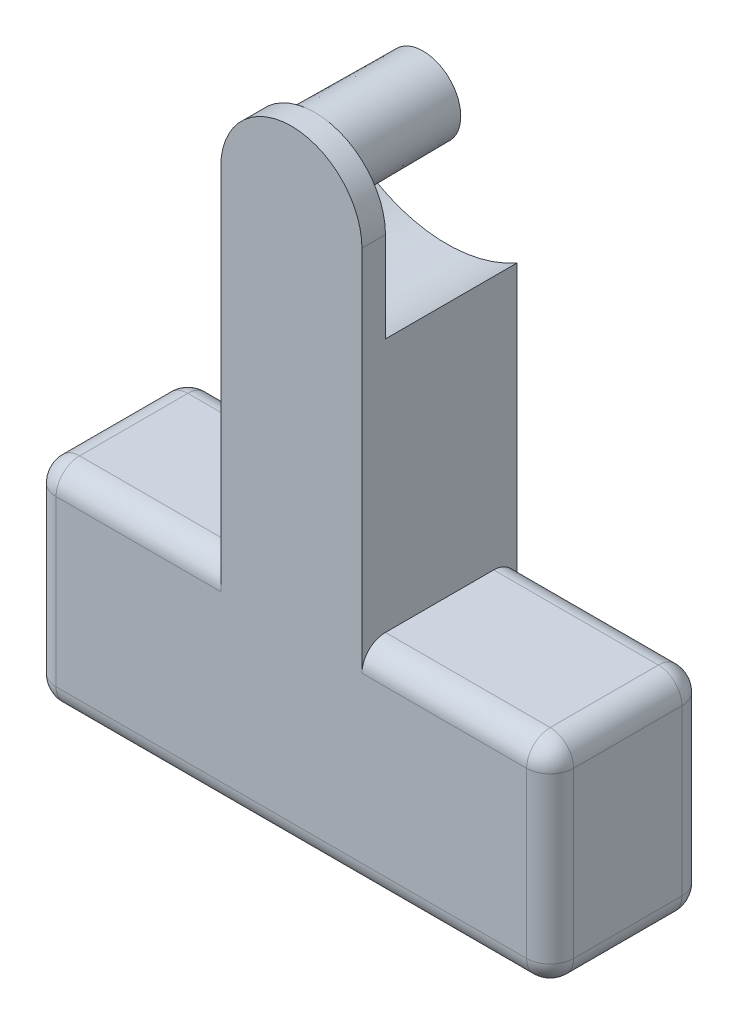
ISO-10303-21;
HEADER;
FILE_DESCRIPTION(('STEP AP214'),'2;1');
FILE_NAME('part.step','',(''),(''),'','','');
FILE_SCHEMA(('AUTOMOTIVE_DESIGN { 1 0 10303 214 1 1 1 1 }'));
ENDSEC;
DATA;
#1=APPLICATION_CONTEXT('core data for automotive mechanical design processes');
#2=APPLICATION_PROTOCOL_DEFINITION('international standard','automotive_design',2000,#1);
#3=PRODUCT_CONTEXT('',#1,'mechanical');
#4=PRODUCT('Part','Part','',(#3));
#5=PRODUCT_RELATED_PRODUCT_CATEGORY('part','',(#4));
#6=PRODUCT_DEFINITION_FORMATION('','',#4);
#7=PRODUCT_DEFINITION_CONTEXT('part definition',#1,'design');
#8=PRODUCT_DEFINITION('design','',#6,#7);
#9=PRODUCT_DEFINITION_SHAPE('','',#8);
#10=(LENGTH_UNIT() NAMED_UNIT(*) SI_UNIT(.MILLI.,.METRE.));
#11=(NAMED_UNIT(*) PLANE_ANGLE_UNIT() SI_UNIT($,.RADIAN.));
#12=(NAMED_UNIT(*) SI_UNIT($,.STERADIAN.) SOLID_ANGLE_UNIT());
#13=UNCERTAINTY_MEASURE_WITH_UNIT(LENGTH_MEASURE(1.E-05),#10,'distance_accuracy_value','');
#14=(GEOMETRIC_REPRESENTATION_CONTEXT(3) GLOBAL_UNCERTAINTY_ASSIGNED_CONTEXT((#13)) GLOBAL_UNIT_ASSIGNED_CONTEXT((#10,
#11,#12)) REPRESENTATION_CONTEXT('',''));
#15=CARTESIAN_POINT('',(0.,0.,0.));
#16=DIRECTION('',(0.,0.,1.));
#17=DIRECTION('',(1.,0.,0.));
#18=AXIS2_PLACEMENT_3D('',#15,#16,#17);
#19=CARTESIAN_POINT('',(0.,-6.79928204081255,11.5));
#20=DIRECTION('',(0.,0.,1.));
#21=DIRECTION('',(1.,0.,0.));
#22=AXIS2_PLACEMENT_3D('',#19,#20,#21);
#23=PLANE('',#22);
#24=DIRECTION('',(0.,1.,0.));
#25=VECTOR('',#24,1.);
#26=CARTESIAN_POINT('',(15.,-80.,11.5));
#27=LINE('',#26,#25);
#28=CARTESIAN_POINT('',(15.,-25.9807621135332,11.5));
#29=VERTEX_POINT('',#28);
#30=CARTESIAN_POINT('',(15.,-6.79928204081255,11.5));
#31=VERTEX_POINT('',#30);
#32=EDGE_CURVE('E194',#29,#31,#27,.T.);
#33=ORIENTED_EDGE('',*,*,#32,.F.);
#34=CARTESIAN_POINT('',(0.,0.,11.5));
#35=DIRECTION('',(0.,0.,-1.));
#36=DIRECTION('',(-1.,0.,0.));
#37=AXIS2_PLACEMENT_3D('',#34,#35,#36);
#38=CIRCLE('',#37,30.);
#39=CARTESIAN_POINT('',(-15.,-25.9807621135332,11.5));
#40=VERTEX_POINT('',#39);
#41=EDGE_CURVE('E203',#29,#40,#38,.T.);
#42=ORIENTED_EDGE('',*,*,#41,.T.);
#43=DIRECTION('',(0.,-1.,0.));
#44=VECTOR('',#43,1.);
#45=CARTESIAN_POINT('',(-15.,-6.79928204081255,11.5));
#46=LINE('',#45,#44);
#47=CARTESIAN_POINT('',(-15.,-6.79928204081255,11.5));
#48=VERTEX_POINT('',#47);
#49=EDGE_CURVE('E215',#48,#40,#46,.T.);
#50=ORIENTED_EDGE('',*,*,#49,.F.);
#51=CARTESIAN_POINT('',(0.,-6.79928204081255,11.5));
#52=DIRECTION('',(0.,0.,1.));
#53=DIRECTION('',(1.,0.,0.));
#54=AXIS2_PLACEMENT_3D('',#51,#52,#53);
#55=CIRCLE('',#54,15.);
#56=CARTESIAN_POINT('',(0.,8.20071795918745,11.5));
#57=VERTEX_POINT('',#56);
#58=EDGE_CURVE('E456',#57,#48,#55,.T.);
#59=ORIENTED_EDGE('',*,*,#58,.F.);
#60=CARTESIAN_POINT('',(0.,0.,11.5));
#61=DIRECTION('',(0.,0.,1.));
#62=DIRECTION('',(1.,0.,0.));
#63=AXIS2_PLACEMENT_3D('',#60,#61,#62);
#64=CIRCLE('',#63,8.20071795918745);
#65=EDGE_CURVE('E238',#57,#57,#64,.T.);
#66=ORIENTED_EDGE('',*,*,#65,.T.);
#67=EDGE_CURVE('E213',#31,#57,#55,.T.);
#68=ORIENTED_EDGE('',*,*,#67,.F.);
#69=EDGE_LOOP('',(#33,#42,#50,#59,#66,#68));
#70=FACE_BOUND('',#69,.T.);
#71=ADVANCED_FACE('F47',(#70),#23,.F.);
#72=CARTESIAN_POINT('',(0.,0.,-11.5));
#73=DIRECTION('',(0.,0.,1.));
#74=DIRECTION('',(1.,0.,0.));
#75=AXIS2_PLACEMENT_3D('',#72,#73,#74);
#76=CONICAL_SURFACE('',#75,8.,0.00872664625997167);
#77=ORIENTED_EDGE('',*,*,#65,.F.);
#78=EDGE_LOOP('',(#77));
#79=FACE_BOUND('',#78,.T.);
#80=CARTESIAN_POINT('',(0.,0.,-11.5));
#81=DIRECTION('',(0.,0.,1.));
#82=DIRECTION('',(1.,0.,0.));
#83=AXIS2_PLACEMENT_3D('',#80,#81,#82);
#84=CIRCLE('',#83,8.);
#85=CARTESIAN_POINT('',(8.,0.,-11.5));
#86=VERTEX_POINT('',#85);
#87=EDGE_CURVE('E235',#86,#86,#84,.T.);
#88=ORIENTED_EDGE('',*,*,#87,.T.);
#89=EDGE_LOOP('',(#88));
#90=FACE_BOUND('',#89,.T.);
#91=ADVANCED_FACE('F478',(#79,#90),#76,.T.);
#92=CARTESIAN_POINT('',(0.,0.,-11.5));
#93=DIRECTION('',(0.,0.,1.));
#94=DIRECTION('',(1.,0.,0.));
#95=AXIS2_PLACEMENT_3D('',#92,#93,#94);
#96=PLANE('',#95);
#97=ORIENTED_EDGE('',*,*,#87,.F.);
#98=EDGE_LOOP('',(#97));
#99=FACE_BOUND('',#98,.T.);
#100=ADVANCED_FACE('F485',(#99),#96,.F.);
#101=CARTESIAN_POINT('',(0.,-6.79928204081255,16.5));
#102=DIRECTION('',(0.,0.,-1.));
#103=DIRECTION('',(-1.,0.,0.));
#104=AXIS2_PLACEMENT_3D('',#101,#102,#103);
#105=CYLINDRICAL_SURFACE('',#104,15.);
#106=ORIENTED_EDGE('',*,*,#67,.T.);
#107=ORIENTED_EDGE('',*,*,#58,.T.);
#108=DIRECTION('',(0.,0.,-1.));
#109=VECTOR('',#108,1.);
#110=CARTESIAN_POINT('',(-15.,-6.79928204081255,16.5));
#111=LINE('',#110,#109);
#112=CARTESIAN_POINT('',(-15.,-6.79928204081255,16.5));
#113=VERTEX_POINT('',#112);
#114=EDGE_CURVE('E232',#113,#48,#111,.T.);
#115=ORIENTED_EDGE('',*,*,#114,.F.);
#116=CARTESIAN_POINT('',(0.,-6.79928204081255,16.5));
#117=DIRECTION('',(0.,0.,1.));
#118=DIRECTION('',(1.,0.,0.));
#119=AXIS2_PLACEMENT_3D('',#116,#117,#118);
#120=CIRCLE('',#119,15.);
#121=CARTESIAN_POINT('',(15.,-6.79928204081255,16.5));
#122=VERTEX_POINT('',#121);
#123=EDGE_CURVE('E214',#122,#113,#120,.T.);
#124=ORIENTED_EDGE('',*,*,#123,.F.);
#125=DIRECTION('',(0.,0.,-1.));
#126=VECTOR('',#125,1.);
#127=CARTESIAN_POINT('',(15.,-6.79928204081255,16.5));
#128=LINE('',#127,#126);
#129=EDGE_CURVE('E223',#122,#31,#128,.T.);
#130=ORIENTED_EDGE('',*,*,#129,.T.);
#131=EDGE_LOOP('',(#106,#107,#115,#124,#130));
#132=FACE_BOUND('',#131,.T.);
#133=ADVANCED_FACE('F465',(#132),#105,.T.);
#134=CARTESIAN_POINT('',(-15.,-6.79928204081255,16.5));
#135=DIRECTION('',(1.,0.,0.));
#136=DIRECTION('',(0.,1.,0.));
#137=AXIS2_PLACEMENT_3D('',#134,#135,#136);
#138=PLANE('',#137);
#139=ORIENTED_EDGE('',*,*,#49,.T.);
#140=DIRECTION('',(0.,0.,1.));
#141=VECTOR('',#140,1.);
#142=CARTESIAN_POINT('',(-15.,-25.9807621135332,-169.502734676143));
#143=LINE('',#142,#141);
#144=CARTESIAN_POINT('',(-15.,-25.9807621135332,-16.5));
#145=VERTEX_POINT('',#144);
#146=EDGE_CURVE('E200',#145,#40,#143,.T.);
#147=ORIENTED_EDGE('',*,*,#146,.F.);
#148=DIRECTION('',(0.,-1.,0.));
#149=VECTOR('',#148,1.);
#150=CARTESIAN_POINT('',(-15.,0.,-16.5));
#151=LINE('',#150,#149);
#152=CARTESIAN_POINT('',(-15.,-85.,-16.5));
#153=VERTEX_POINT('',#152);
#154=EDGE_CURVE('E199',#145,#153,#151,.T.);
#155=ORIENTED_EDGE('',*,*,#154,.T.);
#156=CARTESIAN_POINT('',(-15.,-85.,-11.5));
#157=DIRECTION('',(1.,0.,0.));
#158=DIRECTION('',(0.,1.,0.));
#159=AXIS2_PLACEMENT_3D('',#156,#157,#158);
#160=CIRCLE('',#159,5.);
#161=CARTESIAN_POINT('',(-15.,-80.,-11.5));
#162=VERTEX_POINT('',#161);
#163=EDGE_CURVE('E56',#153,#162,#160,.T.);
#164=ORIENTED_EDGE('',*,*,#163,.T.);
#165=DIRECTION('',(0.,0.,-1.));
#166=VECTOR('',#165,1.);
#167=CARTESIAN_POINT('',(-15.,-80.,16.5));
#168=LINE('',#167,#166);
#169=CARTESIAN_POINT('',(-15.,-80.,11.5));
#170=VERTEX_POINT('',#169);
#171=EDGE_CURVE('E229',#170,#162,#168,.T.);
#172=ORIENTED_EDGE('',*,*,#171,.F.);
#173=CARTESIAN_POINT('',(-15.,-85.,11.5));
#174=DIRECTION('',(1.,0.,0.));
#175=DIRECTION('',(0.,1.,0.));
#176=AXIS2_PLACEMENT_3D('',#173,#174,#175);
#177=CIRCLE('',#176,5.);
#178=CARTESIAN_POINT('',(-15.,-85.,16.5));
#179=VERTEX_POINT('',#178);
#180=EDGE_CURVE('E299',#170,#179,#177,.T.);
#181=ORIENTED_EDGE('',*,*,#180,.T.);
#182=DIRECTION('',(0.,-1.,0.));
#183=VECTOR('',#182,1.);
#184=CARTESIAN_POINT('',(-15.,-6.79928204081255,16.5));
#185=LINE('',#184,#183);
#186=EDGE_CURVE('E218',#113,#179,#185,.T.);
#187=ORIENTED_EDGE('',*,*,#186,.F.);
#188=ORIENTED_EDGE('',*,*,#114,.T.);
#189=EDGE_LOOP('',(#139,#147,#155,#164,#172,#181,#187,#188));
#190=FACE_BOUND('',#189,.T.);
#191=ADVANCED_FACE('F468',(#190),#138,.F.);
#192=CARTESIAN_POINT('',(-15.,-80.,16.5));
#193=DIRECTION('',(0.,-1.,0.));
#194=DIRECTION('',(1.,0.,0.));
#195=AXIS2_PLACEMENT_3D('',#192,#193,#194);
#196=PLANE('',#195);
#197=DIRECTION('',(0.,0.,-1.));
#198=VECTOR('',#197,1.);
#199=CARTESIAN_POINT('',(-50.,-80.,16.5));
#200=LINE('',#199,#198);
#201=CARTESIAN_POINT('',(-50.,-80.,-11.5));
#202=VERTEX_POINT('',#201);
#203=CARTESIAN_POINT('',(-50.,-80.,11.5));
#204=VERTEX_POINT('',#203);
#205=EDGE_CURVE('E272',#202,#204,#200,.F.);
#206=ORIENTED_EDGE('',*,*,#205,.T.);
#207=DIRECTION('',(-1.,0.,0.));
#208=VECTOR('',#207,1.);
#209=CARTESIAN_POINT('',(-15.,-80.,11.5));
#210=LINE('',#209,#208);
#211=EDGE_CURVE('E276',#204,#170,#210,.F.);
#212=ORIENTED_EDGE('',*,*,#211,.T.);
#213=ORIENTED_EDGE('',*,*,#171,.T.);
#214=DIRECTION('',(1.,0.,0.));
#215=VECTOR('',#214,1.);
#216=CARTESIAN_POINT('',(-15.,-80.,-11.5));
#217=LINE('',#216,#215);
#218=EDGE_CURVE('E274',#162,#202,#217,.F.);
#219=ORIENTED_EDGE('',*,*,#218,.T.);
#220=EDGE_LOOP('',(#206,#212,#213,#219));
#221=FACE_BOUND('',#220,.T.);
#222=ADVANCED_FACE('F505',(#221),#196,.F.);
#223=CARTESIAN_POINT('',(-55.,-125.,16.5));
#224=DIRECTION('',(1.,0.,0.));
#225=DIRECTION('',(0.,1.,0.));
#226=AXIS2_PLACEMENT_3D('',#223,#224,#225);
#227=PLANE('',#226);
#228=DIRECTION('',(0.,-1.,0.));
#229=VECTOR('',#228,1.);
#230=CARTESIAN_POINT('',(-55.,-125.,-11.5));
#231=LINE('',#230,#229);
#232=CARTESIAN_POINT('',(-55.,-85.,-11.5));
#233=VERTEX_POINT('',#232);
#234=CARTESIAN_POINT('',(-55.,-120.,-11.5));
#235=VERTEX_POINT('',#234);
#236=EDGE_CURVE('E64',#233,#235,#231,.T.);
#237=ORIENTED_EDGE('',*,*,#236,.T.);
#238=DIRECTION('',(0.,0.,-1.));
#239=VECTOR('',#238,1.);
#240=CARTESIAN_POINT('',(-55.,-120.,16.5));
#241=LINE('',#240,#239);
#242=CARTESIAN_POINT('',(-55.,-120.,11.5));
#243=VERTEX_POINT('',#242);
#244=EDGE_CURVE('E297',#235,#243,#241,.F.);
#245=ORIENTED_EDGE('',*,*,#244,.T.);
#246=DIRECTION('',(0.,-1.,0.));
#247=VECTOR('',#246,1.);
#248=CARTESIAN_POINT('',(-55.,-80.,11.5));
#249=LINE('',#248,#247);
#250=CARTESIAN_POINT('',(-55.,-85.,11.5));
#251=VERTEX_POINT('',#250);
#252=EDGE_CURVE('E293',#243,#251,#249,.F.);
#253=ORIENTED_EDGE('',*,*,#252,.T.);
#254=DIRECTION('',(0.,0.,-1.));
#255=VECTOR('',#254,1.);
#256=CARTESIAN_POINT('',(-55.,-85.,16.5));
#257=LINE('',#256,#255);
#258=EDGE_CURVE('E69',#251,#233,#257,.T.);
#259=ORIENTED_EDGE('',*,*,#258,.T.);
#260=EDGE_LOOP('',(#237,#245,#253,#259));
#261=FACE_BOUND('',#260,.T.);
#262=ADVANCED_FACE('F402',(#261),#227,.F.);
#263=CARTESIAN_POINT('',(55.,-125.,16.5));
#264=DIRECTION('',(0.,1.,0.));
#265=DIRECTION('',(0.,0.,1.));
#266=AXIS2_PLACEMENT_3D('',#263,#264,#265);
#267=PLANE('',#266);
#268=DIRECTION('',(0.,0.,-1.));
#269=VECTOR('',#268,1.);
#270=CARTESIAN_POINT('',(-50.,-125.,16.5));
#271=LINE('',#270,#269);
#272=CARTESIAN_POINT('',(-50.,-125.,11.5));
#273=VERTEX_POINT('',#272);
#274=CARTESIAN_POINT('',(-50.,-125.,-11.5));
#275=VERTEX_POINT('',#274);
#276=EDGE_CURVE('E240',#273,#275,#271,.T.);
#277=ORIENTED_EDGE('',*,*,#276,.T.);
#278=DIRECTION('',(1.,0.,0.));
#279=VECTOR('',#278,1.);
#280=CARTESIAN_POINT('',(55.,-125.,-11.5));
#281=LINE('',#280,#279);
#282=CARTESIAN_POINT('',(50.,-125.,-11.5));
#283=VERTEX_POINT('',#282);
#284=EDGE_CURVE('E246',#275,#283,#281,.T.);
#285=ORIENTED_EDGE('',*,*,#284,.T.);
#286=DIRECTION('',(0.,0.,-1.));
#287=VECTOR('',#286,1.);
#288=CARTESIAN_POINT('',(50.,-125.,16.5));
#289=LINE('',#288,#287);
#290=CARTESIAN_POINT('',(50.,-125.,11.5));
#291=VERTEX_POINT('',#290);
#292=EDGE_CURVE('E244',#283,#291,#289,.F.);
#293=ORIENTED_EDGE('',*,*,#292,.T.);
#294=DIRECTION('',(1.,0.,0.));
#295=VECTOR('',#294,1.);
#296=CARTESIAN_POINT('',(-55.,-125.,11.5));
#297=LINE('',#296,#295);
#298=EDGE_CURVE('E242',#291,#273,#297,.F.);
#299=ORIENTED_EDGE('',*,*,#298,.T.);
#300=EDGE_LOOP('',(#277,#285,#293,#299));
#301=FACE_BOUND('',#300,.T.);
#302=ADVANCED_FACE('F498',(#301),#267,.F.);
#303=CARTESIAN_POINT('',(55.,-125.,16.5));
#304=DIRECTION('',(-1.,0.,0.));
#305=DIRECTION('',(0.,0.,1.));
#306=AXIS2_PLACEMENT_3D('',#303,#304,#305);
#307=PLANE('',#306);
#308=DIRECTION('',(0.,1.,0.));
#309=VECTOR('',#308,1.);
#310=CARTESIAN_POINT('',(55.,-125.,11.5));
#311=LINE('',#310,#309);
#312=CARTESIAN_POINT('',(55.,-85.,11.5));
#313=VERTEX_POINT('',#312);
#314=CARTESIAN_POINT('',(55.,-120.,11.5));
#315=VERTEX_POINT('',#314);
#316=EDGE_CURVE('E284',#313,#315,#311,.F.);
#317=ORIENTED_EDGE('',*,*,#316,.T.);
#318=DIRECTION('',(0.,0.,-1.));
#319=VECTOR('',#318,1.);
#320=CARTESIAN_POINT('',(55.,-120.,16.5));
#321=LINE('',#320,#319);
#322=CARTESIAN_POINT('',(55.,-120.,-11.5));
#323=VERTEX_POINT('',#322);
#324=EDGE_CURVE('E290',#315,#323,#321,.T.);
#325=ORIENTED_EDGE('',*,*,#324,.T.);
#326=DIRECTION('',(0.,1.,0.));
#327=VECTOR('',#326,1.);
#328=CARTESIAN_POINT('',(55.,-125.,-11.5));
#329=LINE('',#328,#327);
#330=CARTESIAN_POINT('',(55.,-85.,-11.5));
#331=VERTEX_POINT('',#330);
#332=EDGE_CURVE('E288',#323,#331,#329,.T.);
#333=ORIENTED_EDGE('',*,*,#332,.T.);
#334=DIRECTION('',(0.,0.,-1.));
#335=VECTOR('',#334,1.);
#336=CARTESIAN_POINT('',(55.,-85.,16.5));
#337=LINE('',#336,#335);
#338=EDGE_CURVE('E286',#331,#313,#337,.F.);
#339=ORIENTED_EDGE('',*,*,#338,.T.);
#340=EDGE_LOOP('',(#317,#325,#333,#339));
#341=FACE_BOUND('',#340,.T.);
#342=ADVANCED_FACE('F495',(#341),#307,.F.);
#343=CARTESIAN_POINT('',(55.,-80.,16.5));
#344=DIRECTION('',(0.,-1.,0.));
#345=DIRECTION('',(0.,0.,-1.));
#346=AXIS2_PLACEMENT_3D('',#343,#344,#345);
#347=PLANE('',#346);
#348=DIRECTION('',(0.,0.,-1.));
#349=VECTOR('',#348,1.);
#350=CARTESIAN_POINT('',(15.,-80.,16.5));
#351=LINE('',#350,#349);
#352=CARTESIAN_POINT('',(15.,-80.,11.5));
#353=VERTEX_POINT('',#352);
#354=CARTESIAN_POINT('',(15.,-80.,-11.5));
#355=VERTEX_POINT('',#354);
#356=EDGE_CURVE('E225',#353,#355,#351,.T.);
#357=ORIENTED_EDGE('',*,*,#356,.F.);
#358=DIRECTION('',(-1.,0.,0.));
#359=VECTOR('',#358,1.);
#360=CARTESIAN_POINT('',(55.,-80.,11.5));
#361=LINE('',#360,#359);
#362=CARTESIAN_POINT('',(50.,-80.,11.5));
#363=VERTEX_POINT('',#362);
#364=EDGE_CURVE('E282',#353,#363,#361,.F.);
#365=ORIENTED_EDGE('',*,*,#364,.T.);
#366=DIRECTION('',(0.,0.,-1.));
#367=VECTOR('',#366,1.);
#368=CARTESIAN_POINT('',(50.,-80.,16.5));
#369=LINE('',#368,#367);
#370=CARTESIAN_POINT('',(50.,-80.,-11.5));
#371=VERTEX_POINT('',#370);
#372=EDGE_CURVE('E278',#363,#371,#369,.T.);
#373=ORIENTED_EDGE('',*,*,#372,.T.);
#374=DIRECTION('',(1.,0.,0.));
#375=VECTOR('',#374,1.);
#376=CARTESIAN_POINT('',(55.,-80.,-11.5));
#377=LINE('',#376,#375);
#378=EDGE_CURVE('E280',#371,#355,#377,.F.);
#379=ORIENTED_EDGE('',*,*,#378,.T.);
#380=EDGE_LOOP('',(#357,#365,#373,#379));
#381=FACE_BOUND('',#380,.T.);
#382=ADVANCED_FACE('F432',(#381),#347,.F.);
#383=CARTESIAN_POINT('',(15.,-80.,16.5));
#384=DIRECTION('',(-1.,0.,0.));
#385=DIRECTION('',(0.,0.,1.));
#386=AXIS2_PLACEMENT_3D('',#383,#384,#385);
#387=PLANE('',#386);
#388=DIRECTION('',(0.,1.,0.));
#389=VECTOR('',#388,1.);
#390=CARTESIAN_POINT('',(15.,-80.,16.5));
#391=LINE('',#390,#389);
#392=CARTESIAN_POINT('',(15.,-85.,16.5));
#393=VERTEX_POINT('',#392);
#394=EDGE_CURVE('E226',#393,#122,#391,.T.);
#395=ORIENTED_EDGE('',*,*,#394,.F.);
#396=CARTESIAN_POINT('',(15.,-85.,11.5));
#397=DIRECTION('',(-1.,0.,0.));
#398=DIRECTION('',(0.,0.,1.));
#399=AXIS2_PLACEMENT_3D('',#396,#397,#398);
#400=CIRCLE('',#399,5.);
#401=EDGE_CURVE('E302',#393,#353,#400,.T.);
#402=ORIENTED_EDGE('',*,*,#401,.T.);
#403=ORIENTED_EDGE('',*,*,#356,.T.);
#404=CARTESIAN_POINT('',(15.,-85.,-11.5));
#405=DIRECTION('',(-1.,0.,0.));
#406=DIRECTION('',(0.,0.,1.));
#407=AXIS2_PLACEMENT_3D('',#404,#405,#406);
#408=CIRCLE('',#407,5.);
#409=CARTESIAN_POINT('',(15.,-85.,-16.5));
#410=VERTEX_POINT('',#409);
#411=EDGE_CURVE('E12',#355,#410,#408,.T.);
#412=ORIENTED_EDGE('',*,*,#411,.T.);
#413=DIRECTION('',(0.,1.,0.));
#414=VECTOR('',#413,1.);
#415=CARTESIAN_POINT('',(15.,0.,-16.5));
#416=LINE('',#415,#414);
#417=CARTESIAN_POINT('',(15.,-25.9807621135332,-16.5));
#418=VERTEX_POINT('',#417);
#419=EDGE_CURVE('E196',#410,#418,#416,.T.);
#420=ORIENTED_EDGE('',*,*,#419,.T.);
#421=DIRECTION('',(0.,0.,1.));
#422=VECTOR('',#421,1.);
#423=CARTESIAN_POINT('',(15.,-25.9807621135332,-169.502734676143));
#424=LINE('',#423,#422);
#425=EDGE_CURVE('E189',#418,#29,#424,.T.);
#426=ORIENTED_EDGE('',*,*,#425,.T.);
#427=ORIENTED_EDGE('',*,*,#32,.T.);
#428=ORIENTED_EDGE('',*,*,#129,.F.);
#429=EDGE_LOOP('',(#395,#402,#403,#412,#420,#426,#427,#428));
#430=FACE_BOUND('',#429,.T.);
#431=ADVANCED_FACE('F191',(#430),#387,.F.);
#432=CARTESIAN_POINT('',(0.,-6.79928204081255,16.5));
#433=DIRECTION('',(0.,0.,1.));
#434=DIRECTION('',(1.,0.,0.));
#435=AXIS2_PLACEMENT_3D('',#432,#433,#434);
#436=PLANE('',#435);
#437=ORIENTED_EDGE('',*,*,#186,.T.);
#438=DIRECTION('',(-1.,0.,0.));
#439=VECTOR('',#438,1.);
#440=CARTESIAN_POINT('',(-55.,-85.,16.5));
#441=LINE('',#440,#439);
#442=CARTESIAN_POINT('',(-50.,-85.,16.5));
#443=VERTEX_POINT('',#442);
#444=EDGE_CURVE('E270',#179,#443,#441,.T.);
#445=ORIENTED_EDGE('',*,*,#444,.T.);
#446=DIRECTION('',(0.,-1.,0.));
#447=VECTOR('',#446,1.);
#448=CARTESIAN_POINT('',(-50.,-125.,16.5));
#449=LINE('',#448,#447);
#450=CARTESIAN_POINT('',(-50.,-120.,16.5));
#451=VERTEX_POINT('',#450);
#452=EDGE_CURVE('E261',#443,#451,#449,.T.);
#453=ORIENTED_EDGE('',*,*,#452,.T.);
#454=DIRECTION('',(1.,0.,0.));
#455=VECTOR('',#454,1.);
#456=CARTESIAN_POINT('',(55.,-120.,16.5));
#457=LINE('',#456,#455);
#458=CARTESIAN_POINT('',(50.,-120.,16.5));
#459=VERTEX_POINT('',#458);
#460=EDGE_CURVE('E263',#451,#459,#457,.T.);
#461=ORIENTED_EDGE('',*,*,#460,.T.);
#462=DIRECTION('',(0.,1.,0.));
#463=VECTOR('',#462,1.);
#464=CARTESIAN_POINT('',(50.,-80.,16.5));
#465=LINE('',#464,#463);
#466=CARTESIAN_POINT('',(50.,-85.,16.5));
#467=VERTEX_POINT('',#466);
#468=EDGE_CURVE('E265',#459,#467,#465,.T.);
#469=ORIENTED_EDGE('',*,*,#468,.T.);
#470=DIRECTION('',(-1.,0.,0.));
#471=VECTOR('',#470,1.);
#472=CARTESIAN_POINT('',(15.,-85.,16.5));
#473=LINE('',#472,#471);
#474=EDGE_CURVE('E267',#467,#393,#473,.T.);
#475=ORIENTED_EDGE('',*,*,#474,.T.);
#476=ORIENTED_EDGE('',*,*,#394,.T.);
#477=ORIENTED_EDGE('',*,*,#123,.T.);
#478=EDGE_LOOP('',(#437,#445,#453,#461,#469,#475,#476,#477));
#479=FACE_BOUND('',#478,.T.);
#480=ADVANCED_FACE('F409',(#479),#436,.T.);
#481=CARTESIAN_POINT('',(0.,0.,-169.502734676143));
#482=DIRECTION('',(0.,0.,1.));
#483=DIRECTION('',(1.,0.,0.));
#484=AXIS2_PLACEMENT_3D('',#481,#482,#483);
#485=CYLINDRICAL_SURFACE('',#484,30.);
#486=CARTESIAN_POINT('',(0.,0.,-16.5));
#487=DIRECTION('',(0.,0.,1.));
#488=DIRECTION('',(1.,0.,0.));
#489=AXIS2_PLACEMENT_3D('',#486,#487,#488);
#490=CIRCLE('',#489,30.);
#491=EDGE_CURVE('E454',#145,#418,#490,.T.);
#492=ORIENTED_EDGE('',*,*,#491,.F.);
#493=ORIENTED_EDGE('',*,*,#146,.T.);
#494=ORIENTED_EDGE('',*,*,#41,.F.);
#495=ORIENTED_EDGE('',*,*,#425,.F.);
#496=EDGE_LOOP('',(#492,#493,#494,#495));
#497=FACE_BOUND('',#496,.T.);
#498=ADVANCED_FACE('F204',(#497),#485,.F.);
#499=CARTESIAN_POINT('',(0.,0.,-16.5));
#500=DIRECTION('',(0.,0.,1.));
#501=DIRECTION('',(1.,0.,0.));
#502=AXIS2_PLACEMENT_3D('',#499,#500,#501);
#503=PLANE('',#502);
#504=ORIENTED_EDGE('',*,*,#419,.F.);
#505=DIRECTION('',(1.,0.,0.));
#506=VECTOR('',#505,1.);
#507=CARTESIAN_POINT('',(0.,-85.,-16.5));
#508=LINE('',#507,#506);
#509=CARTESIAN_POINT('',(50.,-85.,-16.5));
#510=VERTEX_POINT('',#509);
#511=EDGE_CURVE('E259',#410,#510,#508,.T.);
#512=ORIENTED_EDGE('',*,*,#511,.T.);
#513=DIRECTION('',(0.,1.,0.));
#514=VECTOR('',#513,1.);
#515=CARTESIAN_POINT('',(50.,0.,-16.5));
#516=LINE('',#515,#514);
#517=CARTESIAN_POINT('',(50.,-120.,-16.5));
#518=VERTEX_POINT('',#517);
#519=EDGE_CURVE('E257',#510,#518,#516,.F.);
#520=ORIENTED_EDGE('',*,*,#519,.T.);
#521=DIRECTION('',(1.,0.,0.));
#522=VECTOR('',#521,1.);
#523=CARTESIAN_POINT('',(0.,-120.,-16.5));
#524=LINE('',#523,#522);
#525=CARTESIAN_POINT('',(-50.,-120.,-16.5));
#526=VERTEX_POINT('',#525);
#527=EDGE_CURVE('E254',#518,#526,#524,.F.);
#528=ORIENTED_EDGE('',*,*,#527,.T.);
#529=DIRECTION('',(0.,-1.,0.));
#530=VECTOR('',#529,1.);
#531=CARTESIAN_POINT('',(-50.,0.,-16.5));
#532=LINE('',#531,#530);
#533=CARTESIAN_POINT('',(-50.,-85.,-16.5));
#534=VERTEX_POINT('',#533);
#535=EDGE_CURVE('E249',#526,#534,#532,.F.);
#536=ORIENTED_EDGE('',*,*,#535,.T.);
#537=DIRECTION('',(1.,0.,0.));
#538=VECTOR('',#537,1.);
#539=CARTESIAN_POINT('',(0.,-85.,-16.5));
#540=LINE('',#539,#538);
#541=EDGE_CURVE('E251',#534,#153,#540,.T.);
#542=ORIENTED_EDGE('',*,*,#541,.T.);
#543=ORIENTED_EDGE('',*,*,#154,.F.);
#544=ORIENTED_EDGE('',*,*,#491,.T.);
#545=EDGE_LOOP('',(#504,#512,#520,#528,#536,#542,#543,#544));
#546=FACE_BOUND('',#545,.T.);
#547=ADVANCED_FACE('F453',(#546),#503,.F.);
#548=CARTESIAN_POINT('',(0.,-85.,11.5));
#549=DIRECTION('',(1.,0.,0.));
#550=DIRECTION('',(0.,1.,0.));
#551=AXIS2_PLACEMENT_3D('',#548,#549,#550);
#552=CYLINDRICAL_SURFACE('',#551,5.);
#553=ORIENTED_EDGE('',*,*,#180,.F.);
#554=ORIENTED_EDGE('',*,*,#211,.F.);
#555=CARTESIAN_POINT('',(-50.,-85.,11.5));
#556=DIRECTION('',(-1.,0.,0.));
#557=DIRECTION('',(0.,0.,1.));
#558=AXIS2_PLACEMENT_3D('',#555,#556,#557);
#559=CIRCLE('',#558,5.);
#560=EDGE_CURVE('E51',#443,#204,#559,.T.);
#561=ORIENTED_EDGE('',*,*,#560,.F.);
#562=ORIENTED_EDGE('',*,*,#444,.F.);
#563=EDGE_LOOP('',(#553,#554,#561,#562));
#564=FACE_BOUND('',#563,.T.);
#565=ADVANCED_FACE('F49',(#564),#552,.T.);
#566=CARTESIAN_POINT('',(0.,-85.,11.5));
#567=DIRECTION('',(1.,0.,0.));
#568=DIRECTION('',(0.,0.,-1.));
#569=AXIS2_PLACEMENT_3D('',#566,#567,#568);
#570=CYLINDRICAL_SURFACE('',#569,5.);
#571=ORIENTED_EDGE('',*,*,#401,.F.);
#572=ORIENTED_EDGE('',*,*,#474,.F.);
#573=CARTESIAN_POINT('',(50.,-85.,11.5));
#574=DIRECTION('',(1.,0.,0.));
#575=DIRECTION('',(0.,0.,-1.));
#576=AXIS2_PLACEMENT_3D('',#573,#574,#575);
#577=CIRCLE('',#576,5.);
#578=EDGE_CURVE('E366',#363,#467,#577,.T.);
#579=ORIENTED_EDGE('',*,*,#578,.F.);
#580=ORIENTED_EDGE('',*,*,#364,.F.);
#581=EDGE_LOOP('',(#571,#572,#579,#580));
#582=FACE_BOUND('',#581,.T.);
#583=ADVANCED_FACE('F427',(#582),#570,.T.);
#584=CARTESIAN_POINT('',(-50.,-85.,11.5));
#585=DIRECTION('',(0.,1.,0.));
#586=DIRECTION('',(0.,0.,1.));
#587=AXIS2_PLACEMENT_3D('',#584,#585,#586);
#588=SPHERICAL_SURFACE('',#587,5.);
#589=CARTESIAN_POINT('',(-50.,-85.,11.5));
#590=DIRECTION('',(0.,1.,0.));
#591=DIRECTION('',(0.,0.,1.));
#592=AXIS2_PLACEMENT_3D('',#589,#590,#591);
#593=CIRCLE('',#592,5.);
#594=EDGE_CURVE('E361',#443,#251,#593,.F.);
#595=ORIENTED_EDGE('',*,*,#594,.F.);
#596=ORIENTED_EDGE('',*,*,#560,.T.);
#597=CARTESIAN_POINT('',(-50.,-85.,11.5));
#598=DIRECTION('',(0.,0.,1.));
#599=DIRECTION('',(1.,0.,0.));
#600=AXIS2_PLACEMENT_3D('',#597,#598,#599);
#601=CIRCLE('',#600,5.);
#602=EDGE_CURVE('E364',#251,#204,#601,.F.);
#603=ORIENTED_EDGE('',*,*,#602,.F.);
#604=EDGE_LOOP('',(#595,#596,#603));
#605=FACE_BOUND('',#604,.T.);
#606=ADVANCED_FACE('F377',(#605),#588,.T.);
#607=CARTESIAN_POINT('',(50.,-85.,11.5));
#608=DIRECTION('',(0.,0.,1.));
#609=DIRECTION('',(1.,0.,0.));
#610=AXIS2_PLACEMENT_3D('',#607,#608,#609);
#611=SPHERICAL_SURFACE('',#610,5.);
#612=CARTESIAN_POINT('',(50.,-85.,11.5));
#613=DIRECTION('',(0.,0.,1.));
#614=DIRECTION('',(1.,0.,0.));
#615=AXIS2_PLACEMENT_3D('',#612,#613,#614);
#616=CIRCLE('',#615,5.);
#617=EDGE_CURVE('E355',#363,#313,#616,.F.);
#618=ORIENTED_EDGE('',*,*,#617,.F.);
#619=ORIENTED_EDGE('',*,*,#578,.T.);
#620=CARTESIAN_POINT('',(50.,-85.,11.5));
#621=DIRECTION('',(0.,1.,0.));
#622=DIRECTION('',(0.,0.,1.));
#623=AXIS2_PLACEMENT_3D('',#620,#621,#622);
#624=CIRCLE('',#623,5.);
#625=EDGE_CURVE('E358',#313,#467,#624,.F.);
#626=ORIENTED_EDGE('',*,*,#625,.F.);
#627=EDGE_LOOP('',(#618,#619,#626));
#628=FACE_BOUND('',#627,.T.);
#629=ADVANCED_FACE('F560',(#628),#611,.T.);
#630=CARTESIAN_POINT('',(0.,-85.,-11.5));
#631=DIRECTION('',(1.,0.,0.));
#632=DIRECTION('',(0.,1.,0.));
#633=AXIS2_PLACEMENT_3D('',#630,#631,#632);
#634=CYLINDRICAL_SURFACE('',#633,5.);
#635=ORIENTED_EDGE('',*,*,#163,.F.);
#636=ORIENTED_EDGE('',*,*,#541,.F.);
#637=CARTESIAN_POINT('',(-50.,-85.,-11.5));
#638=DIRECTION('',(-1.,0.,0.));
#639=DIRECTION('',(0.,0.,1.));
#640=AXIS2_PLACEMENT_3D('',#637,#638,#639);
#641=CIRCLE('',#640,5.);
#642=EDGE_CURVE('E352',#202,#534,#641,.T.);
#643=ORIENTED_EDGE('',*,*,#642,.F.);
#644=ORIENTED_EDGE('',*,*,#218,.F.);
#645=EDGE_LOOP('',(#635,#636,#643,#644));
#646=FACE_BOUND('',#645,.T.);
#647=ADVANCED_FACE('F557',(#646),#634,.T.);
#648=CARTESIAN_POINT('',(-50.,-85.,16.5));
#649=DIRECTION('',(0.,0.,-1.));
#650=DIRECTION('',(-1.,0.,0.));
#651=AXIS2_PLACEMENT_3D('',#648,#649,#650);
#652=CYLINDRICAL_SURFACE('',#651,5.);
#653=ORIENTED_EDGE('',*,*,#602,.T.);
#654=ORIENTED_EDGE('',*,*,#205,.F.);
#655=CARTESIAN_POINT('',(-50.,-85.,-11.5));
#656=DIRECTION('',(0.,0.,-1.));
#657=DIRECTION('',(-1.,0.,0.));
#658=AXIS2_PLACEMENT_3D('',#655,#656,#657);
#659=CIRCLE('',#658,5.);
#660=EDGE_CURVE('E349',#233,#202,#659,.T.);
#661=ORIENTED_EDGE('',*,*,#660,.F.);
#662=ORIENTED_EDGE('',*,*,#258,.F.);
#663=EDGE_LOOP('',(#653,#654,#661,#662));
#664=FACE_BOUND('',#663,.T.);
#665=ADVANCED_FACE('F384',(#664),#652,.T.);
#666=CARTESIAN_POINT('',(-50.,-6.79928204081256,11.5));
#667=DIRECTION('',(0.,1.,0.));
#668=DIRECTION('',(-1.,0.,0.));
#669=AXIS2_PLACEMENT_3D('',#666,#667,#668);
#670=CYLINDRICAL_SURFACE('',#669,5.);
#671=ORIENTED_EDGE('',*,*,#594,.T.);
#672=ORIENTED_EDGE('',*,*,#252,.F.);
#673=CARTESIAN_POINT('',(-50.,-120.,11.5));
#674=DIRECTION('',(0.,-1.,0.));
#675=DIRECTION('',(0.,0.,-1.));
#676=AXIS2_PLACEMENT_3D('',#673,#674,#675);
#677=CIRCLE('',#676,5.);
#678=EDGE_CURVE('E346',#451,#243,#677,.T.);
#679=ORIENTED_EDGE('',*,*,#678,.F.);
#680=ORIENTED_EDGE('',*,*,#452,.F.);
#681=EDGE_LOOP('',(#671,#672,#679,#680));
#682=FACE_BOUND('',#681,.T.);
#683=ADVANCED_FACE('F406',(#682),#670,.T.);
#684=CARTESIAN_POINT('',(0.,-120.,11.5));
#685=DIRECTION('',(-1.,0.,0.));
#686=DIRECTION('',(0.,0.,1.));
#687=AXIS2_PLACEMENT_3D('',#684,#685,#686);
#688=CYLINDRICAL_SURFACE('',#687,5.);
#689=CARTESIAN_POINT('',(50.,-120.,11.5));
#690=DIRECTION('',(1.,0.,0.));
#691=DIRECTION('',(0.,0.,-1.));
#692=AXIS2_PLACEMENT_3D('',#689,#690,#691);
#693=CIRCLE('',#692,5.);
#694=EDGE_CURVE('E340',#459,#291,#693,.T.);
#695=ORIENTED_EDGE('',*,*,#694,.F.);
#696=ORIENTED_EDGE('',*,*,#460,.F.);
#697=CARTESIAN_POINT('',(-50.,-120.,11.5));
#698=DIRECTION('',(-1.,0.,0.));
#699=DIRECTION('',(0.,0.,1.));
#700=AXIS2_PLACEMENT_3D('',#697,#698,#699);
#701=CIRCLE('',#700,5.);
#702=EDGE_CURVE('E343',#273,#451,#701,.T.);
#703=ORIENTED_EDGE('',*,*,#702,.F.);
#704=ORIENTED_EDGE('',*,*,#298,.F.);
#705=EDGE_LOOP('',(#695,#696,#703,#704));
#706=FACE_BOUND('',#705,.T.);
#707=ADVANCED_FACE('F414',(#706),#688,.T.);
#708=CARTESIAN_POINT('',(50.,-6.79928204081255,11.5));
#709=DIRECTION('',(0.,-1.,0.));
#710=DIRECTION('',(0.,0.,-1.));
#711=AXIS2_PLACEMENT_3D('',#708,#709,#710);
#712=CYLINDRICAL_SURFACE('',#711,5.);
#713=ORIENTED_EDGE('',*,*,#625,.T.);
#714=ORIENTED_EDGE('',*,*,#468,.F.);
#715=CARTESIAN_POINT('',(50.,-120.,11.5));
#716=DIRECTION('',(0.,-1.,0.));
#717=DIRECTION('',(0.,0.,-1.));
#718=AXIS2_PLACEMENT_3D('',#715,#716,#717);
#719=CIRCLE('',#718,5.);
#720=EDGE_CURVE('E337',#315,#459,#719,.T.);
#721=ORIENTED_EDGE('',*,*,#720,.F.);
#722=ORIENTED_EDGE('',*,*,#316,.F.);
#723=EDGE_LOOP('',(#713,#714,#721,#722));
#724=FACE_BOUND('',#723,.T.);
#725=ADVANCED_FACE('F423',(#724),#712,.T.);
#726=CARTESIAN_POINT('',(50.,-85.,16.5));
#727=DIRECTION('',(0.,0.,-1.));
#728=DIRECTION('',(-1.,0.,0.));
#729=AXIS2_PLACEMENT_3D('',#726,#727,#728);
#730=CYLINDRICAL_SURFACE('',#729,5.);
#731=ORIENTED_EDGE('',*,*,#617,.T.);
#732=ORIENTED_EDGE('',*,*,#338,.F.);
#733=CARTESIAN_POINT('',(50.,-85.,-11.5));
#734=DIRECTION('',(0.,0.,-1.));
#735=DIRECTION('',(-1.,0.,0.));
#736=AXIS2_PLACEMENT_3D('',#733,#734,#735);
#737=CIRCLE('',#736,5.);
#738=EDGE_CURVE('E334',#371,#331,#737,.T.);
#739=ORIENTED_EDGE('',*,*,#738,.F.);
#740=ORIENTED_EDGE('',*,*,#372,.F.);
#741=EDGE_LOOP('',(#731,#732,#739,#740));
#742=FACE_BOUND('',#741,.T.);
#743=ADVANCED_FACE('F443',(#742),#730,.T.);
#744=CARTESIAN_POINT('',(0.,-85.,-11.5));
#745=DIRECTION('',(1.,0.,0.));
#746=DIRECTION('',(0.,0.,-1.));
#747=AXIS2_PLACEMENT_3D('',#744,#745,#746);
#748=CYLINDRICAL_SURFACE('',#747,5.);
#749=ORIENTED_EDGE('',*,*,#411,.F.);
#750=ORIENTED_EDGE('',*,*,#378,.F.);
#751=CARTESIAN_POINT('',(50.,-85.,-11.5));
#752=DIRECTION('',(1.,0.,0.));
#753=DIRECTION('',(0.,0.,-1.));
#754=AXIS2_PLACEMENT_3D('',#751,#752,#753);
#755=CIRCLE('',#754,5.);
#756=EDGE_CURVE('E331',#510,#371,#755,.T.);
#757=ORIENTED_EDGE('',*,*,#756,.F.);
#758=ORIENTED_EDGE('',*,*,#511,.F.);
#759=EDGE_LOOP('',(#749,#750,#757,#758));
#760=FACE_BOUND('',#759,.T.);
#761=ADVANCED_FACE('F438',(#760),#748,.T.);
#762=CARTESIAN_POINT('',(-50.,-85.,-11.5));
#763=DIRECTION('',(0.,1.,0.));
#764=DIRECTION('',(0.,0.,1.));
#765=AXIS2_PLACEMENT_3D('',#762,#763,#764);
#766=SPHERICAL_SURFACE('',#765,5.);
#767=ORIENTED_EDGE('',*,*,#660,.T.);
#768=ORIENTED_EDGE('',*,*,#642,.T.);
#769=CARTESIAN_POINT('',(-50.,-85.,-11.5));
#770=DIRECTION('',(0.,1.,0.));
#771=DIRECTION('',(0.,0.,1.));
#772=AXIS2_PLACEMENT_3D('',#769,#770,#771);
#773=CIRCLE('',#772,5.);
#774=EDGE_CURVE('E328',#233,#534,#773,.F.);
#775=ORIENTED_EDGE('',*,*,#774,.F.);
#776=EDGE_LOOP('',(#767,#768,#775));
#777=FACE_BOUND('',#776,.T.);
#778=ADVANCED_FACE('F388',(#777),#766,.T.);
#779=CARTESIAN_POINT('',(-50.,-120.,11.5));
#780=DIRECTION('',(0.,0.,1.));
#781=DIRECTION('',(1.,0.,0.));
#782=AXIS2_PLACEMENT_3D('',#779,#780,#781);
#783=SPHERICAL_SURFACE('',#782,5.);
#784=ORIENTED_EDGE('',*,*,#702,.T.);
#785=ORIENTED_EDGE('',*,*,#678,.T.);
#786=CARTESIAN_POINT('',(-50.,-120.,11.5));
#787=DIRECTION('',(0.,0.,1.));
#788=DIRECTION('',(1.,0.,0.));
#789=AXIS2_PLACEMENT_3D('',#786,#787,#788);
#790=CIRCLE('',#789,5.);
#791=EDGE_CURVE('E326',#273,#243,#790,.F.);
#792=ORIENTED_EDGE('',*,*,#791,.F.);
#793=EDGE_LOOP('',(#784,#785,#792));
#794=FACE_BOUND('',#793,.T.);
#795=ADVANCED_FACE('F539',(#794),#783,.T.);
#796=CARTESIAN_POINT('',(50.,-120.,11.5));
#797=DIRECTION('',(0.,0.,1.));
#798=DIRECTION('',(1.,0.,0.));
#799=AXIS2_PLACEMENT_3D('',#796,#797,#798);
#800=SPHERICAL_SURFACE('',#799,5.);
#801=ORIENTED_EDGE('',*,*,#720,.T.);
#802=ORIENTED_EDGE('',*,*,#694,.T.);
#803=CARTESIAN_POINT('',(50.,-120.,11.5));
#804=DIRECTION('',(0.,0.,1.));
#805=DIRECTION('',(1.,0.,0.));
#806=AXIS2_PLACEMENT_3D('',#803,#804,#805);
#807=CIRCLE('',#806,5.);
#808=EDGE_CURVE('E323',#315,#291,#807,.F.);
#809=ORIENTED_EDGE('',*,*,#808,.F.);
#810=EDGE_LOOP('',(#801,#802,#809));
#811=FACE_BOUND('',#810,.T.);
#812=ADVANCED_FACE('F419',(#811),#800,.T.);
#813=CARTESIAN_POINT('',(50.,-85.,-11.5));
#814=DIRECTION('',(0.,1.,0.));
#815=DIRECTION('',(0.,0.,1.));
#816=AXIS2_PLACEMENT_3D('',#813,#814,#815);
#817=SPHERICAL_SURFACE('',#816,5.);
#818=ORIENTED_EDGE('',*,*,#756,.T.);
#819=ORIENTED_EDGE('',*,*,#738,.T.);
#820=CARTESIAN_POINT('',(50.,-85.,-11.5));
#821=DIRECTION('',(0.,1.,0.));
#822=DIRECTION('',(0.,0.,1.));
#823=AXIS2_PLACEMENT_3D('',#820,#821,#822);
#824=CIRCLE('',#823,5.);
#825=EDGE_CURVE('E320',#510,#331,#824,.F.);
#826=ORIENTED_EDGE('',*,*,#825,.F.);
#827=EDGE_LOOP('',(#818,#819,#826));
#828=FACE_BOUND('',#827,.T.);
#829=ADVANCED_FACE('F445',(#828),#817,.T.);
#830=CARTESIAN_POINT('',(-50.,-125.,-11.5));
#831=DIRECTION('',(0.,-1.,0.));
#832=DIRECTION('',(1.,0.,0.));
#833=AXIS2_PLACEMENT_3D('',#830,#831,#832);
#834=CYLINDRICAL_SURFACE('',#833,5.);
#835=ORIENTED_EDGE('',*,*,#774,.T.);
#836=ORIENTED_EDGE('',*,*,#535,.F.);
#837=CARTESIAN_POINT('',(-50.,-120.,-11.5));
#838=DIRECTION('',(0.,-1.,0.));
#839=DIRECTION('',(0.,0.,-1.));
#840=AXIS2_PLACEMENT_3D('',#837,#838,#839);
#841=CIRCLE('',#840,5.);
#842=EDGE_CURVE('E317',#235,#526,#841,.T.);
#843=ORIENTED_EDGE('',*,*,#842,.F.);
#844=ORIENTED_EDGE('',*,*,#236,.F.);
#845=EDGE_LOOP('',(#835,#836,#843,#844));
#846=FACE_BOUND('',#845,.T.);
#847=ADVANCED_FACE('F392',(#846),#834,.T.);
#848=CARTESIAN_POINT('',(-50.,-120.,16.5));
#849=DIRECTION('',(0.,0.,-1.));
#850=DIRECTION('',(-1.,0.,0.));
#851=AXIS2_PLACEMENT_3D('',#848,#849,#850);
#852=CYLINDRICAL_SURFACE('',#851,5.);
#853=ORIENTED_EDGE('',*,*,#791,.T.);
#854=ORIENTED_EDGE('',*,*,#244,.F.);
#855=CARTESIAN_POINT('',(-50.,-120.,-11.5));
#856=DIRECTION('',(0.,0.,-1.));
#857=DIRECTION('',(-1.,0.,0.));
#858=AXIS2_PLACEMENT_3D('',#855,#856,#857);
#859=CIRCLE('',#858,5.);
#860=EDGE_CURVE('E314',#275,#235,#859,.T.);
#861=ORIENTED_EDGE('',*,*,#860,.F.);
#862=ORIENTED_EDGE('',*,*,#276,.F.);
#863=EDGE_LOOP('',(#853,#854,#861,#862));
#864=FACE_BOUND('',#863,.T.);
#865=ADVANCED_FACE('F400',(#864),#852,.T.);
#866=CARTESIAN_POINT('',(50.,-120.,16.5));
#867=DIRECTION('',(0.,0.,-1.));
#868=DIRECTION('',(-1.,0.,0.));
#869=AXIS2_PLACEMENT_3D('',#866,#867,#868);
#870=CYLINDRICAL_SURFACE('',#869,5.);
#871=ORIENTED_EDGE('',*,*,#808,.T.);
#872=ORIENTED_EDGE('',*,*,#292,.F.);
#873=CARTESIAN_POINT('',(50.,-120.,-11.5));
#874=DIRECTION('',(0.,0.,-1.));
#875=DIRECTION('',(-1.,0.,0.));
#876=AXIS2_PLACEMENT_3D('',#873,#874,#875);
#877=CIRCLE('',#876,5.);
#878=EDGE_CURVE('E311',#323,#283,#877,.T.);
#879=ORIENTED_EDGE('',*,*,#878,.F.);
#880=ORIENTED_EDGE('',*,*,#324,.F.);
#881=EDGE_LOOP('',(#871,#872,#879,#880));
#882=FACE_BOUND('',#881,.T.);
#883=ADVANCED_FACE('F527',(#882),#870,.T.);
#884=CARTESIAN_POINT('',(50.,-125.,-11.5));
#885=DIRECTION('',(0.,1.,0.));
#886=DIRECTION('',(0.,0.,1.));
#887=AXIS2_PLACEMENT_3D('',#884,#885,#886);
#888=CYLINDRICAL_SURFACE('',#887,5.);
#889=ORIENTED_EDGE('',*,*,#825,.T.);
#890=ORIENTED_EDGE('',*,*,#332,.F.);
#891=CARTESIAN_POINT('',(50.,-120.,-11.5));
#892=DIRECTION('',(0.,-1.,0.));
#893=DIRECTION('',(0.,0.,-1.));
#894=AXIS2_PLACEMENT_3D('',#891,#892,#893);
#895=CIRCLE('',#894,5.);
#896=EDGE_CURVE('E309',#518,#323,#895,.T.);
#897=ORIENTED_EDGE('',*,*,#896,.F.);
#898=ORIENTED_EDGE('',*,*,#519,.F.);
#899=EDGE_LOOP('',(#889,#890,#897,#898));
#900=FACE_BOUND('',#899,.T.);
#901=ADVANCED_FACE('F450',(#900),#888,.T.);
#902=CARTESIAN_POINT('',(-50.,-120.,-11.5));
#903=DIRECTION('',(-1.,0.,0.));
#904=DIRECTION('',(0.,0.,1.));
#905=AXIS2_PLACEMENT_3D('',#902,#903,#904);
#906=SPHERICAL_SURFACE('',#905,5.);
#907=ORIENTED_EDGE('',*,*,#860,.T.);
#908=ORIENTED_EDGE('',*,*,#842,.T.);
#909=CARTESIAN_POINT('',(-50.,-120.,-11.5));
#910=DIRECTION('',(-1.,0.,0.));
#911=DIRECTION('',(0.,-1.,0.));
#912=AXIS2_PLACEMENT_3D('',#909,#910,#911);
#913=CIRCLE('',#912,5.);
#914=EDGE_CURVE('E307',#275,#526,#913,.F.);
#915=ORIENTED_EDGE('',*,*,#914,.F.);
#916=EDGE_LOOP('',(#907,#908,#915));
#917=FACE_BOUND('',#916,.T.);
#918=ADVANCED_FACE('F396',(#917),#906,.T.);
#919=CARTESIAN_POINT('',(50.,-120.,-11.5));
#920=DIRECTION('',(1.,0.,0.));
#921=DIRECTION('',(0.,0.,-1.));
#922=AXIS2_PLACEMENT_3D('',#919,#920,#921);
#923=SPHERICAL_SURFACE('',#922,5.);
#924=ORIENTED_EDGE('',*,*,#896,.T.);
#925=ORIENTED_EDGE('',*,*,#878,.T.);
#926=CARTESIAN_POINT('',(50.,-120.,-11.5));
#927=DIRECTION('',(1.,0.,0.));
#928=DIRECTION('',(0.,0.,-1.));
#929=AXIS2_PLACEMENT_3D('',#926,#927,#928);
#930=CIRCLE('',#929,5.);
#931=EDGE_CURVE('E305',#518,#283,#930,.F.);
#932=ORIENTED_EDGE('',*,*,#931,.F.);
#933=EDGE_LOOP('',(#924,#925,#932));
#934=FACE_BOUND('',#933,.T.);
#935=ADVANCED_FACE('F518',(#934),#923,.T.);
#936=CARTESIAN_POINT('',(55.,-120.,-11.5));
#937=DIRECTION('',(1.,0.,0.));
#938=DIRECTION('',(0.,0.,-1.));
#939=AXIS2_PLACEMENT_3D('',#936,#937,#938);
#940=CYLINDRICAL_SURFACE('',#939,5.);
#941=ORIENTED_EDGE('',*,*,#914,.T.);
#942=ORIENTED_EDGE('',*,*,#527,.F.);
#943=ORIENTED_EDGE('',*,*,#931,.T.);
#944=ORIENTED_EDGE('',*,*,#284,.F.);
#945=EDGE_LOOP('',(#941,#942,#943,#944));
#946=FACE_BOUND('',#945,.T.);
#947=ADVANCED_FACE('F515',(#946),#940,.T.);
#948=CLOSED_SHELL('',(#71,#91,#100,#133,#191,#222,#262,#302,#342,#382,#431,#480,#498,#547,#565,
#583,#606,#629,#647,#665,#683,#707,#725,#743,#761,#778,#795,#812,#829,#847,#865,#883,#901,#918,
#935,#947));
#949=MANIFOLD_SOLID_BREP('B2',#948);
#950=ADVANCED_BREP_SHAPE_REPRESENTATION('',(#18,#949),#14);
#951=SHAPE_DEFINITION_REPRESENTATION(#9,#950);
ENDSEC;
END-ISO-10303-21;
